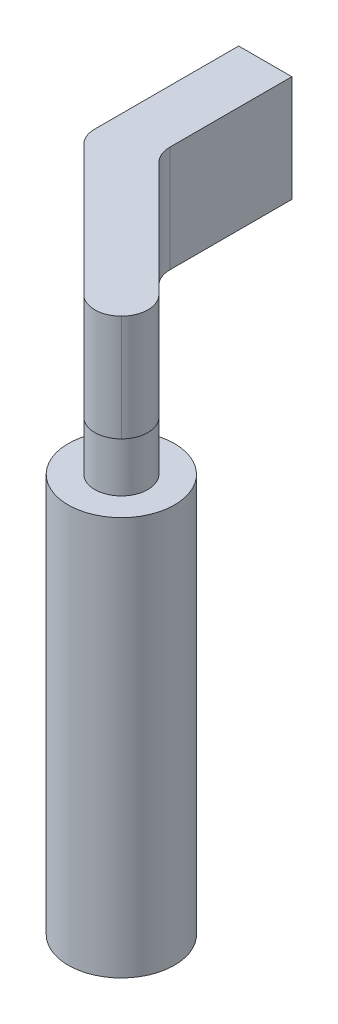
ISO-10303-21;
HEADER;
FILE_DESCRIPTION(('STEP AP214'),'2;1');
FILE_NAME('part.step','',(''),(''),'','','');
FILE_SCHEMA(('AUTOMOTIVE_DESIGN { 1 0 10303 214 1 1 1 1 }'));
ENDSEC;
DATA;
#1=APPLICATION_CONTEXT('core data for automotive mechanical design processes');
#2=APPLICATION_PROTOCOL_DEFINITION('international standard','automotive_design',2000,#1);
#3=PRODUCT_CONTEXT('',#1,'mechanical');
#4=PRODUCT('Part','Part','',(#3));
#5=PRODUCT_RELATED_PRODUCT_CATEGORY('part','',(#4));
#6=PRODUCT_DEFINITION_FORMATION('','',#4);
#7=PRODUCT_DEFINITION_CONTEXT('part definition',#1,'design');
#8=PRODUCT_DEFINITION('design','',#6,#7);
#9=PRODUCT_DEFINITION_SHAPE('','',#8);
#10=(LENGTH_UNIT() NAMED_UNIT(*) SI_UNIT(.MILLI.,.METRE.));
#11=(NAMED_UNIT(*) PLANE_ANGLE_UNIT() SI_UNIT($,.RADIAN.));
#12=(NAMED_UNIT(*) SI_UNIT($,.STERADIAN.) SOLID_ANGLE_UNIT());
#13=UNCERTAINTY_MEASURE_WITH_UNIT(LENGTH_MEASURE(1.E-05),#10,'distance_accuracy_value','');
#14=(GEOMETRIC_REPRESENTATION_CONTEXT(3) GLOBAL_UNCERTAINTY_ASSIGNED_CONTEXT((#13)) GLOBAL_UNIT_ASSIGNED_CONTEXT((#10,
#11,#12)) REPRESENTATION_CONTEXT('',''));
#15=CARTESIAN_POINT('',(0.,0.,0.));
#16=DIRECTION('',(0.,0.,1.));
#17=DIRECTION('',(1.,0.,0.));
#18=AXIS2_PLACEMENT_3D('',#15,#16,#17);
#19=CARTESIAN_POINT('',(0.,0.,0.));
#20=DIRECTION('',(0.,-1.,0.));
#21=DIRECTION('',(0.,0.,-1.));
#22=AXIS2_PLACEMENT_3D('',#19,#20,#21);
#23=PLANE('',#22);
#24=DIRECTION('',(-0.707106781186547,0.,-0.707106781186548));
#25=VECTOR('',#24,1.);
#26=CARTESIAN_POINT('',(20.,0.,50.));
#27=LINE('',#26,#25);
#28=CARTESIAN_POINT('',(65.9619407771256,0.,95.9619407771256));
#29=VERTEX_POINT('',#28);
#30=CARTESIAN_POINT('',(64.5477272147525,0.,94.5477272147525));
#31=VERTEX_POINT('',#30);
#32=EDGE_CURVE('E112',#29,#31,#27,.T.);
#33=ORIENTED_EDGE('',*,*,#32,.F.);
#34=CARTESIAN_POINT('',(58.8908729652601,0.,103.033008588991));
#35=DIRECTION('',(0.,-1.,0.));
#36=DIRECTION('',(0.,0.,-1.));
#37=AXIS2_PLACEMENT_3D('',#34,#35,#36);
#38=CIRCLE('',#37,10.);
#39=CARTESIAN_POINT('',(65.9619407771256,0.,110.104076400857));
#40=VERTEX_POINT('',#39);
#41=EDGE_CURVE('E190',#29,#40,#38,.T.);
#42=ORIENTED_EDGE('',*,*,#41,.T.);
#43=CARTESIAN_POINT('',(58.8908729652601,0.,103.033008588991));
#44=DIRECTION('',(0.,-1.,0.));
#45=DIRECTION('',(0.,0.,-1.));
#46=AXIS2_PLACEMENT_3D('',#43,#44,#45);
#47=CIRCLE('',#46,10.);
#48=CARTESIAN_POINT('',(51.8198051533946,0.,110.104076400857));
#49=VERTEX_POINT('',#48);
#50=EDGE_CURVE('E188',#40,#49,#47,.T.);
#51=ORIENTED_EDGE('',*,*,#50,.T.);
#52=DIRECTION('',(0.707106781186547,0.,0.707106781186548));
#53=VECTOR('',#52,1.);
#54=CARTESIAN_POINT('',(58.8908729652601,0.,117.175144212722));
#55=LINE('',#54,#53);
#56=CARTESIAN_POINT('',(50.4055915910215,0.,108.689862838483));
#57=VERTEX_POINT('',#56);
#58=EDGE_CURVE('E137',#57,#49,#55,.T.);
#59=ORIENTED_EDGE('',*,*,#58,.F.);
#60=CARTESIAN_POINT('',(57.476659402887,0.,101.618795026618));
#61=DIRECTION('',(0.,-1.,0.));
#62=DIRECTION('',(0.,0.,-1.));
#63=AXIS2_PLACEMENT_3D('',#60,#61,#62);
#64=CIRCLE('',#63,10.);
#65=EDGE_CURVE('E136',#31,#57,#64,.T.);
#66=ORIENTED_EDGE('',*,*,#65,.F.);
#67=EDGE_LOOP('',(#33,#42,#51,#59,#66));
#68=FACE_BOUND('',#67,.T.);
#69=ADVANCED_FACE('F33',(#68),#23,.T.);
#70=CARTESIAN_POINT('',(0.,40.,58.2842712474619));
#71=DIRECTION('',(1.,0.,0.));
#72=DIRECTION('',(0.,0.,-1.));
#73=AXIS2_PLACEMENT_3D('',#70,#71,#72);
#74=PLANE('',#73);
#75=DIRECTION('',(0.,0.,1.));
#76=VECTOR('',#75,1.);
#77=CARTESIAN_POINT('',(0.,0.,58.2842712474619));
#78=LINE('',#77,#76);
#79=CARTESIAN_POINT('',(0.,0.,0.));
#80=VERTEX_POINT('',#79);
#81=CARTESIAN_POINT('',(0.,0.,54.1421356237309));
#82=VERTEX_POINT('',#81);
#83=EDGE_CURVE('E166',#80,#82,#78,.T.);
#84=ORIENTED_EDGE('',*,*,#83,.T.);
#85=DIRECTION('',(0.,-1.,0.));
#86=VECTOR('',#85,1.);
#87=CARTESIAN_POINT('',(0.,40.,54.1421356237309));
#88=LINE('',#87,#86);
#89=CARTESIAN_POINT('',(0.,40.,54.1421356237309));
#90=VERTEX_POINT('',#89);
#91=EDGE_CURVE('E180',#82,#90,#88,.F.);
#92=ORIENTED_EDGE('',*,*,#91,.T.);
#93=DIRECTION('',(0.,0.,1.));
#94=VECTOR('',#93,1.);
#95=CARTESIAN_POINT('',(0.,40.,58.2842712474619));
#96=LINE('',#95,#94);
#97=CARTESIAN_POINT('',(0.,40.,0.));
#98=VERTEX_POINT('',#97);
#99=EDGE_CURVE('E154',#98,#90,#96,.T.);
#100=ORIENTED_EDGE('',*,*,#99,.F.);
#101=DIRECTION('',(0.,-1.,0.));
#102=VECTOR('',#101,1.);
#103=CARTESIAN_POINT('',(0.,40.,0.));
#104=LINE('',#103,#102);
#105=EDGE_CURVE('E149',#98,#80,#104,.T.);
#106=ORIENTED_EDGE('',*,*,#105,.T.);
#107=EDGE_LOOP('',(#84,#92,#100,#106));
#108=FACE_BOUND('',#107,.T.);
#109=ADVANCED_FACE('F225',(#108),#74,.F.);
#110=CARTESIAN_POINT('',(58.8908729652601,40.,117.175144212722));
#111=DIRECTION('',(0.707106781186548,0.,-0.707106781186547));
#112=DIRECTION('',(-0.707106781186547,0.,-0.707106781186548));
#113=AXIS2_PLACEMENT_3D('',#110,#111,#112);
#114=PLANE('',#113);
#115=ORIENTED_EDGE('',*,*,#58,.T.);
#116=DIRECTION('',(0.,-1.,0.));
#117=VECTOR('',#116,1.);
#118=CARTESIAN_POINT('',(51.8198051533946,40.,110.104076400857));
#119=LINE('',#118,#117);
#120=CARTESIAN_POINT('',(51.8198051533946,40.,110.104076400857));
#121=VERTEX_POINT('',#120);
#122=EDGE_CURVE('E11',#49,#121,#119,.F.);
#123=ORIENTED_EDGE('',*,*,#122,.T.);
#124=DIRECTION('',(0.707106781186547,0.,0.707106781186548));
#125=VECTOR('',#124,1.);
#126=CARTESIAN_POINT('',(58.8908729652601,40.,117.175144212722));
#127=LINE('',#126,#125);
#128=CARTESIAN_POINT('',(2.92893218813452,40.,61.2132034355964));
#129=VERTEX_POINT('',#128);
#130=EDGE_CURVE('E157',#129,#121,#127,.T.);
#131=ORIENTED_EDGE('',*,*,#130,.F.);
#132=DIRECTION('',(0.,-1.,0.));
#133=VECTOR('',#132,1.);
#134=CARTESIAN_POINT('',(2.92893218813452,40.,61.2132034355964));
#135=LINE('',#134,#133);
#136=CARTESIAN_POINT('',(2.92893218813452,0.,61.2132034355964));
#137=VERTEX_POINT('',#136);
#138=EDGE_CURVE('E175',#129,#137,#135,.T.);
#139=ORIENTED_EDGE('',*,*,#138,.T.);
#140=EDGE_CURVE('E134',#137,#57,#55,.T.);
#141=ORIENTED_EDGE('',*,*,#140,.T.);
#142=EDGE_LOOP('',(#115,#123,#131,#139,#141));
#143=FACE_BOUND('',#142,.T.);
#144=ADVANCED_FACE('F232',(#143),#114,.F.);
#145=CARTESIAN_POINT('',(20.,40.,50.));
#146=DIRECTION('',(-0.707106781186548,0.,0.707106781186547));
#147=DIRECTION('',(0.707106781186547,0.,0.707106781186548));
#148=AXIS2_PLACEMENT_3D('',#145,#146,#147);
#149=PLANE('',#148);
#150=DIRECTION('',(-0.707106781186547,0.,-0.707106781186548));
#151=VECTOR('',#150,1.);
#152=CARTESIAN_POINT('',(20.,40.,50.));
#153=LINE('',#152,#151);
#154=CARTESIAN_POINT('',(65.9619407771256,40.,95.9619407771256));
#155=VERTEX_POINT('',#154);
#156=CARTESIAN_POINT('',(22.9289321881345,40.,52.9289321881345));
#157=VERTEX_POINT('',#156);
#158=EDGE_CURVE('E160',#155,#157,#153,.T.);
#159=ORIENTED_EDGE('',*,*,#158,.F.);
#160=DIRECTION('',(0.,-1.,0.));
#161=VECTOR('',#160,1.);
#162=CARTESIAN_POINT('',(65.9619407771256,40.,95.9619407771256));
#163=LINE('',#162,#161);
#164=EDGE_CURVE('E120',#155,#29,#163,.T.);
#165=ORIENTED_EDGE('',*,*,#164,.T.);
#166=ORIENTED_EDGE('',*,*,#32,.T.);
#167=CARTESIAN_POINT('',(22.9289321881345,0.,52.9289321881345));
#168=VERTEX_POINT('',#167);
#169=EDGE_CURVE('E117',#31,#168,#27,.T.);
#170=ORIENTED_EDGE('',*,*,#169,.T.);
#171=DIRECTION('',(0.,-1.,0.));
#172=VECTOR('',#171,1.);
#173=CARTESIAN_POINT('',(22.9289321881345,40.,52.9289321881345));
#174=LINE('',#173,#172);
#175=EDGE_CURVE('E146',#168,#157,#174,.F.);
#176=ORIENTED_EDGE('',*,*,#175,.T.);
#177=EDGE_LOOP('',(#159,#165,#166,#170,#176));
#178=FACE_BOUND('',#177,.T.);
#179=ADVANCED_FACE('F115',(#178),#149,.F.);
#180=CARTESIAN_POINT('',(20.,40.,0.));
#181=DIRECTION('',(-1.,0.,0.));
#182=DIRECTION('',(0.,0.,1.));
#183=AXIS2_PLACEMENT_3D('',#180,#181,#182);
#184=PLANE('',#183);
#185=DIRECTION('',(0.,0.,-1.));
#186=VECTOR('',#185,1.);
#187=CARTESIAN_POINT('',(20.,40.,0.));
#188=LINE('',#187,#186);
#189=CARTESIAN_POINT('',(20.,40.,45.857864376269));
#190=VERTEX_POINT('',#189);
#191=CARTESIAN_POINT('',(20.,40.,0.));
#192=VERTEX_POINT('',#191);
#193=EDGE_CURVE('E162',#190,#192,#188,.T.);
#194=ORIENTED_EDGE('',*,*,#193,.F.);
#195=DIRECTION('',(0.,-1.,0.));
#196=VECTOR('',#195,1.);
#197=CARTESIAN_POINT('',(20.,0.,45.857864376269));
#198=LINE('',#197,#196);
#199=CARTESIAN_POINT('',(20.,0.,45.857864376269));
#200=VERTEX_POINT('',#199);
#201=EDGE_CURVE('E143',#190,#200,#198,.T.);
#202=ORIENTED_EDGE('',*,*,#201,.T.);
#203=DIRECTION('',(0.,0.,-1.));
#204=VECTOR('',#203,1.);
#205=CARTESIAN_POINT('',(20.,0.,0.));
#206=LINE('',#205,#204);
#207=CARTESIAN_POINT('',(20.,0.,0.));
#208=VERTEX_POINT('',#207);
#209=EDGE_CURVE('E123',#200,#208,#206,.T.);
#210=ORIENTED_EDGE('',*,*,#209,.T.);
#211=DIRECTION('',(0.,-1.,0.));
#212=VECTOR('',#211,1.);
#213=CARTESIAN_POINT('',(20.,40.,0.));
#214=LINE('',#213,#212);
#215=EDGE_CURVE('E144',#192,#208,#214,.T.);
#216=ORIENTED_EDGE('',*,*,#215,.F.);
#217=EDGE_LOOP('',(#194,#202,#210,#216));
#218=FACE_BOUND('',#217,.T.);
#219=ADVANCED_FACE('F251',(#218),#184,.F.);
#220=CARTESIAN_POINT('',(0.,40.,0.));
#221=DIRECTION('',(0.,0.,1.));
#222=DIRECTION('',(1.,0.,0.));
#223=AXIS2_PLACEMENT_3D('',#220,#221,#222);
#224=PLANE('',#223);
#225=DIRECTION('',(-1.,0.,0.));
#226=VECTOR('',#225,1.);
#227=CARTESIAN_POINT('',(0.,0.,0.));
#228=LINE('',#227,#226);
#229=EDGE_CURVE('E158',#208,#80,#228,.T.);
#230=ORIENTED_EDGE('',*,*,#229,.T.);
#231=ORIENTED_EDGE('',*,*,#105,.F.);
#232=DIRECTION('',(-1.,0.,0.));
#233=VECTOR('',#232,1.);
#234=CARTESIAN_POINT('',(0.,40.,0.));
#235=LINE('',#234,#233);
#236=EDGE_CURVE('E164',#192,#98,#235,.T.);
#237=ORIENTED_EDGE('',*,*,#236,.F.);
#238=ORIENTED_EDGE('',*,*,#215,.T.);
#239=EDGE_LOOP('',(#230,#231,#237,#238));
#240=FACE_BOUND('',#239,.T.);
#241=ADVANCED_FACE('F245',(#240),#224,.F.);
#242=CARTESIAN_POINT('',(0.,40.,0.));
#243=DIRECTION('',(0.,-1.,0.));
#244=DIRECTION('',(0.,0.,-1.));
#245=AXIS2_PLACEMENT_3D('',#242,#243,#244);
#246=PLANE('',#245);
#247=CARTESIAN_POINT('',(58.8908729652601,40.,103.033008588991));
#248=DIRECTION('',(0.,-1.,0.));
#249=DIRECTION('',(0.,0.,-1.));
#250=AXIS2_PLACEMENT_3D('',#247,#248,#249);
#251=CIRCLE('',#250,10.);
#252=CARTESIAN_POINT('',(65.9619407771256,40.,110.104076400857));
#253=VERTEX_POINT('',#252);
#254=EDGE_CURVE('E49',#121,#253,#251,.F.);
#255=ORIENTED_EDGE('',*,*,#254,.T.);
#256=CARTESIAN_POINT('',(58.8908729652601,40.,103.033008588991));
#257=DIRECTION('',(0.,-1.,0.));
#258=DIRECTION('',(0.,0.,-1.));
#259=AXIS2_PLACEMENT_3D('',#256,#257,#258);
#260=CIRCLE('',#259,10.);
#261=EDGE_CURVE('E42',#253,#155,#260,.F.);
#262=ORIENTED_EDGE('',*,*,#261,.T.);
#263=ORIENTED_EDGE('',*,*,#158,.T.);
#264=CARTESIAN_POINT('',(30.,40.,45.857864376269));
#265=DIRECTION('',(0.,-1.,0.));
#266=DIRECTION('',(0.,0.,-1.));
#267=AXIS2_PLACEMENT_3D('',#264,#265,#266);
#268=CIRCLE('',#267,10.);
#269=EDGE_CURVE('E185',#157,#190,#268,.T.);
#270=ORIENTED_EDGE('',*,*,#269,.T.);
#271=ORIENTED_EDGE('',*,*,#193,.T.);
#272=ORIENTED_EDGE('',*,*,#236,.T.);
#273=ORIENTED_EDGE('',*,*,#99,.T.);
#274=CARTESIAN_POINT('',(10.,40.,54.1421356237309));
#275=DIRECTION('',(0.,-1.,0.));
#276=DIRECTION('',(0.,0.,-1.));
#277=AXIS2_PLACEMENT_3D('',#274,#275,#276);
#278=CIRCLE('',#277,10.);
#279=EDGE_CURVE('E182',#90,#129,#278,.F.);
#280=ORIENTED_EDGE('',*,*,#279,.T.);
#281=ORIENTED_EDGE('',*,*,#130,.T.);
#282=EDGE_LOOP('',(#255,#262,#263,#270,#271,#272,#273,#280,#281));
#283=FACE_BOUND('',#282,.T.);
#284=ADVANCED_FACE('F194',(#283),#246,.F.);
#285=ORIENTED_EDGE('',*,*,#140,.F.);
#286=CARTESIAN_POINT('',(10.,0.,54.1421356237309));
#287=DIRECTION('',(0.,-1.,0.));
#288=DIRECTION('',(0.,0.,-1.));
#289=AXIS2_PLACEMENT_3D('',#286,#287,#288);
#290=CIRCLE('',#289,10.);
#291=EDGE_CURVE('E178',#137,#82,#290,.T.);
#292=ORIENTED_EDGE('',*,*,#291,.T.);
#293=ORIENTED_EDGE('',*,*,#83,.F.);
#294=ORIENTED_EDGE('',*,*,#229,.F.);
#295=ORIENTED_EDGE('',*,*,#209,.F.);
#296=CARTESIAN_POINT('',(30.,0.,45.857864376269));
#297=DIRECTION('',(0.,-1.,0.));
#298=DIRECTION('',(0.,0.,-1.));
#299=AXIS2_PLACEMENT_3D('',#296,#297,#298);
#300=CIRCLE('',#299,10.);
#301=EDGE_CURVE('E133',#200,#168,#300,.F.);
#302=ORIENTED_EDGE('',*,*,#301,.T.);
#303=ORIENTED_EDGE('',*,*,#169,.F.);
#304=EDGE_CURVE('E130',#57,#31,#64,.T.);
#305=ORIENTED_EDGE('',*,*,#304,.F.);
#306=EDGE_LOOP('',(#285,#292,#293,#294,#295,#302,#303,#305));
#307=FACE_BOUND('',#306,.T.);
#308=ADVANCED_FACE('F128',(#307),#23,.T.);
#309=CARTESIAN_POINT('',(57.476659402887,-20.,101.618795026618));
#310=DIRECTION('',(0.,1.,0.));
#311=DIRECTION('',(0.,0.,1.));
#312=AXIS2_PLACEMENT_3D('',#309,#310,#311);
#313=CYLINDRICAL_SURFACE('',#312,10.);
#314=CARTESIAN_POINT('',(57.476659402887,-20.,101.618795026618));
#315=DIRECTION('',(0.,-1.,0.));
#316=DIRECTION('',(0.,0.,-1.));
#317=AXIS2_PLACEMENT_3D('',#314,#315,#316);
#318=CIRCLE('',#317,10.);
#319=CARTESIAN_POINT('',(57.476659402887,-20.,91.618795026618));
#320=VERTEX_POINT('',#319);
#321=EDGE_CURVE('E139',#320,#320,#318,.T.);
#322=ORIENTED_EDGE('',*,*,#321,.F.);
#323=EDGE_LOOP('',(#322));
#324=FACE_BOUND('',#323,.T.);
#325=ORIENTED_EDGE('',*,*,#65,.T.);
#326=ORIENTED_EDGE('',*,*,#304,.T.);
#327=EDGE_LOOP('',(#325,#326));
#328=FACE_BOUND('',#327,.T.);
#329=ADVANCED_FACE('F142',(#324,#328),#313,.T.);
#330=CARTESIAN_POINT('',(57.476659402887,-20.,101.618795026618));
#331=DIRECTION('',(0.,-1.,0.));
#332=DIRECTION('',(0.,0.,-1.));
#333=AXIS2_PLACEMENT_3D('',#330,#331,#332);
#334=PLANE('',#333);
#335=CARTESIAN_POINT('',(57.476659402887,-20.,101.618795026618));
#336=DIRECTION('',(0.,-1.,0.));
#337=DIRECTION('',(0.,0.,-1.));
#338=AXIS2_PLACEMENT_3D('',#335,#336,#337);
#339=CIRCLE('',#338,20.);
#340=CARTESIAN_POINT('',(57.476659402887,-20.,81.618795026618));
#341=VERTEX_POINT('',#340);
#342=EDGE_CURVE('E201',#341,#341,#339,.T.);
#343=ORIENTED_EDGE('',*,*,#342,.F.);
#344=EDGE_LOOP('',(#343));
#345=FACE_BOUND('',#344,.T.);
#346=ORIENTED_EDGE('',*,*,#321,.T.);
#347=EDGE_LOOP('',(#346));
#348=FACE_BOUND('',#347,.T.);
#349=ADVANCED_FACE('F213',(#345,#348),#334,.F.);
#350=CARTESIAN_POINT('',(57.476659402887,-170.,101.618795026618));
#351=DIRECTION('',(0.,1.,0.));
#352=DIRECTION('',(0.,0.,1.));
#353=AXIS2_PLACEMENT_3D('',#350,#351,#352);
#354=CYLINDRICAL_SURFACE('',#353,20.);
#355=CARTESIAN_POINT('',(57.476659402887,-170.,101.618795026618));
#356=DIRECTION('',(0.,-1.,0.));
#357=DIRECTION('',(0.,0.,-1.));
#358=AXIS2_PLACEMENT_3D('',#355,#356,#357);
#359=CIRCLE('',#358,20.);
#360=CARTESIAN_POINT('',(57.476659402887,-170.,81.618795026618));
#361=VERTEX_POINT('',#360);
#362=EDGE_CURVE('E140',#361,#361,#359,.T.);
#363=ORIENTED_EDGE('',*,*,#362,.F.);
#364=EDGE_LOOP('',(#363));
#365=FACE_BOUND('',#364,.T.);
#366=ORIENTED_EDGE('',*,*,#342,.T.);
#367=EDGE_LOOP('',(#366));
#368=FACE_BOUND('',#367,.T.);
#369=ADVANCED_FACE('F211',(#365,#368),#354,.T.);
#370=CARTESIAN_POINT('',(57.476659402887,-170.,101.618795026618));
#371=DIRECTION('',(0.,-1.,0.));
#372=DIRECTION('',(0.,0.,-1.));
#373=AXIS2_PLACEMENT_3D('',#370,#371,#372);
#374=PLANE('',#373);
#375=ORIENTED_EDGE('',*,*,#362,.T.);
#376=EDGE_LOOP('',(#375));
#377=FACE_BOUND('',#376,.T.);
#378=ADVANCED_FACE('F209',(#377),#374,.T.);
#379=CARTESIAN_POINT('',(30.,40.,45.857864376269));
#380=DIRECTION('',(0.,1.,0.));
#381=DIRECTION('',(0.,0.,1.));
#382=AXIS2_PLACEMENT_3D('',#379,#380,#381);
#383=CYLINDRICAL_SURFACE('',#382,10.);
#384=ORIENTED_EDGE('',*,*,#269,.F.);
#385=ORIENTED_EDGE('',*,*,#175,.F.);
#386=ORIENTED_EDGE('',*,*,#301,.F.);
#387=ORIENTED_EDGE('',*,*,#201,.F.);
#388=EDGE_LOOP('',(#384,#385,#386,#387));
#389=FACE_BOUND('',#388,.T.);
#390=ADVANCED_FACE('F219',(#389),#383,.F.);
#391=CARTESIAN_POINT('',(10.,40.,54.1421356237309));
#392=DIRECTION('',(0.,-1.,0.));
#393=DIRECTION('',(0.,0.,-1.));
#394=AXIS2_PLACEMENT_3D('',#391,#392,#393);
#395=CYLINDRICAL_SURFACE('',#394,10.);
#396=ORIENTED_EDGE('',*,*,#279,.F.);
#397=ORIENTED_EDGE('',*,*,#91,.F.);
#398=ORIENTED_EDGE('',*,*,#291,.F.);
#399=ORIENTED_EDGE('',*,*,#138,.F.);
#400=EDGE_LOOP('',(#396,#397,#398,#399));
#401=FACE_BOUND('',#400,.T.);
#402=ADVANCED_FACE('F263',(#401),#395,.T.);
#403=CARTESIAN_POINT('',(58.8908729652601,40.,103.033008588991));
#404=DIRECTION('',(0.,-1.,0.));
#405=DIRECTION('',(0.,0.,-1.));
#406=AXIS2_PLACEMENT_3D('',#403,#404,#405);
#407=CYLINDRICAL_SURFACE('',#406,10.);
#408=DIRECTION('',(0.,-1.,0.));
#409=VECTOR('',#408,1.);
#410=CARTESIAN_POINT('',(65.9619407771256,40.,110.104076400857));
#411=LINE('',#410,#409);
#412=EDGE_CURVE('E37',#253,#40,#411,.T.);
#413=ORIENTED_EDGE('',*,*,#412,.F.);
#414=ORIENTED_EDGE('',*,*,#254,.F.);
#415=ORIENTED_EDGE('',*,*,#122,.F.);
#416=ORIENTED_EDGE('',*,*,#50,.F.);
#417=EDGE_LOOP('',(#413,#414,#415,#416));
#418=FACE_BOUND('',#417,.T.);
#419=ADVANCED_FACE('F35',(#418),#407,.T.);
#420=CARTESIAN_POINT('',(58.8908729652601,40.,103.033008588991));
#421=DIRECTION('',(0.,-1.,0.));
#422=DIRECTION('',(0.,0.,-1.));
#423=AXIS2_PLACEMENT_3D('',#420,#421,#422);
#424=CYLINDRICAL_SURFACE('',#423,10.);
#425=ORIENTED_EDGE('',*,*,#261,.F.);
#426=ORIENTED_EDGE('',*,*,#412,.T.);
#427=ORIENTED_EDGE('',*,*,#41,.F.);
#428=ORIENTED_EDGE('',*,*,#164,.F.);
#429=EDGE_LOOP('',(#425,#426,#427,#428));
#430=FACE_BOUND('',#429,.T.);
#431=ADVANCED_FACE('F198',(#430),#424,.T.);
#432=CLOSED_SHELL('',(#69,#109,#144,#179,#219,#241,#284,#308,#329,#349,#369,#378,#390,#402,#419,#431));
#433=MANIFOLD_SOLID_BREP('B2',#432);
#434=ADVANCED_BREP_SHAPE_REPRESENTATION('',(#18,#433),#14);
#435=SHAPE_DEFINITION_REPRESENTATION(#9,#434);
ENDSEC;
END-ISO-10303-21;
